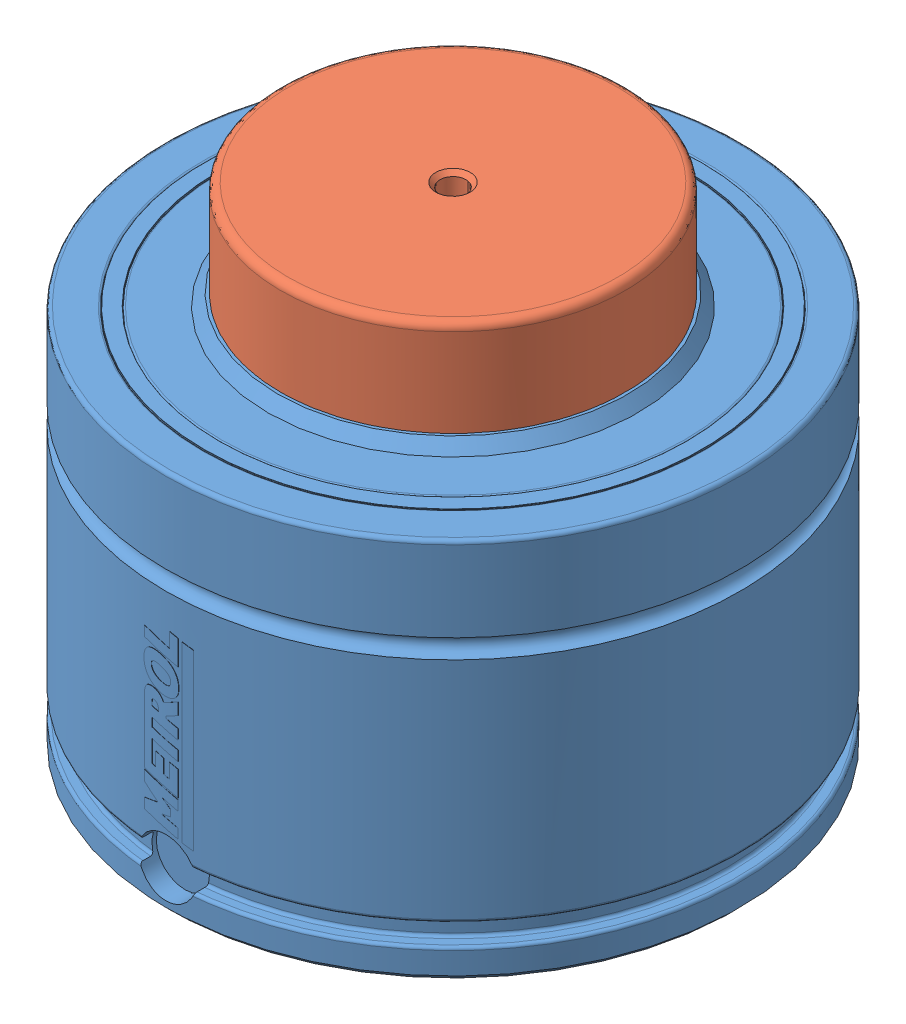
SolidWorks assembly EX9500-025.SLDASM, configuration Default (file format 7000). Lengths in mm.
Overall size (150 128 150.03).
2 component instances, 2 part files, 5 mates.
Components (placement in the parent):
- EX-9500 BODY-1: EX-9500 BODY.SLDPRT [EX-9500-025] x (0 0 1) z (0 -1 0) size (150.03 150 103)
- EX-9500 PISTON-1: EX-9500 PISTON.SLDPRT [EX-9500-025] at (0 70 0) x (-0.361052 0 -0.932546) z (0 -1 0) size (110 110 58)
Mates (geometry in assembly coordinates):
- Concentric1: concentric aligned: cylinder of EX-9500 BODY-1 through (0 0 0) axis (0 -1 0) radius 75; cylinder of EX-9500 PISTON-1 through (0 70 0) axis (0 -1 0) radius 45
- LimitDistance1: limit distance anti-aligned: plane of EX-9500 BODY-1 through (-45 80 0) normal (0 -1 0); plane of EX-9500 PISTON-1 through (41.9646 80 -16.2473) normal (0 1 0)
- Coincident1: coincident anti-aligned: plane of EX-9500 BODY-1 through (0 0 0) normal (0 -1 0); plane of assembly through (0 0 0) normal (0 1 0)
- Coincident2: coincident aligned: plane of EX-9500 BODY-1; plane of assembly through (0 0 0) normal (0 0 1)
- Coincident3: coincident anti-aligned: plane of EX-9500 BODY-1; plane of assembly through (0 0 0) normal (1 0 0)
